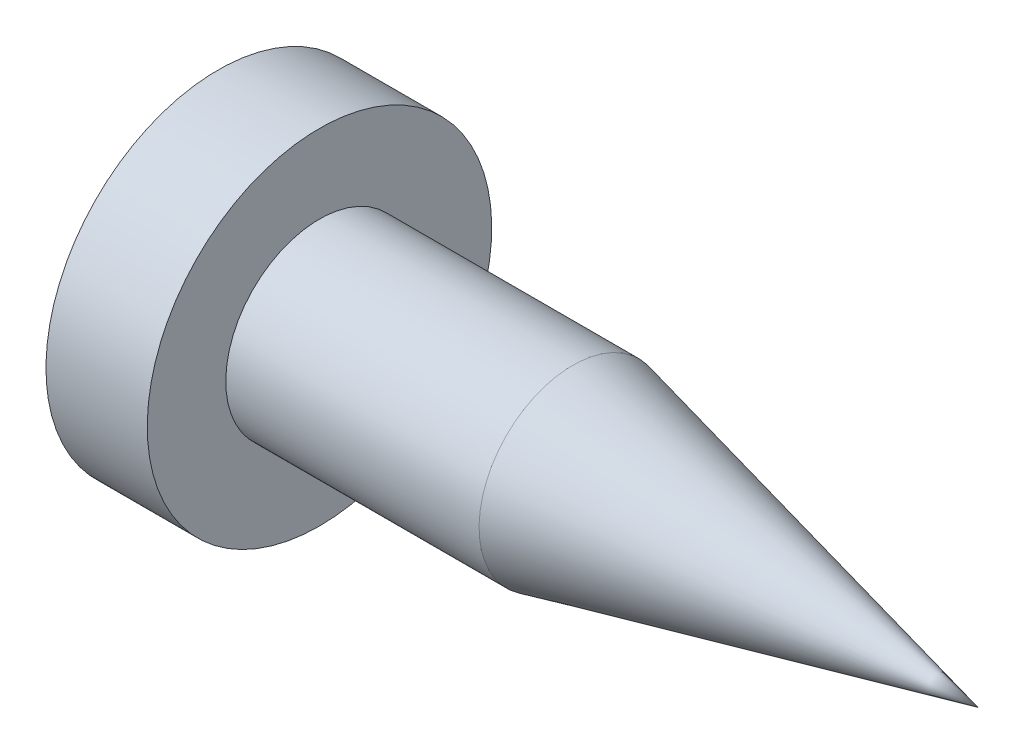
from build123d import *

# Parameters (mm, degrees)
ENL_V_MAT_EXTRU_1_DEPTH = 10


with BuildPart() as part:
    # Esquisse1 → Base-R_volution (revolve)
    with BuildSketch(Plane.XY, mode=Mode.PRIVATE) as base_r_volution_sk:
        with BuildLine():
            Line((0, 1.85), (5, 1.85))
            Line((5, 1.85), (13, 0))
            Line((13, 0), (-3, 0))
            ThreePointArc((-3, 0), (-2.74481535, 1.772004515), (-2, 3.4))
            Line((-2, 3.4), (0, 3.4))
            Line((0, 3.4), (0, 1.85))
        make_face()
    revolve(base_r_volution_sk.sketch.rotate(Axis((-2, 0, 0), (1, 0, 0)), 180), axis=Axis((-2, 0, 0), (1, 0, 0)))

    # Esquisse2 → Enl_v. mat.-Extru.1 (cut)
    with BuildSketch(Plane(origin=(-1, 0, 0), x_dir=(0, 0, -1), z_dir=(1, 0, 0))):
        with BuildLine():
            Line((0.7, -0.5), (2, -0.5))
            Line((2, -0.5), (2, 0.5))
            Line((2, 0.5), (0.7, 0.5))
            ThreePointArc((0.7, 0.5), (0.558578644, 0.558578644), (0.5, 0.7))
            Line((0.5, 0.7), (0.5, 2))
            Line((0.5, 2), (-0.5, 2))
            Line((-0.5, 2), (-0.5, 0.7))
            ThreePointArc((-0.5, 0.7), (-0.558578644, 0.558578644), (-0.7, 0.5))
            Line((-0.7, 0.5), (-2, 0.5))
            Line((-2, 0.5), (-2, -0.5))
            Line((-2, -0.5), (-0.7, -0.5))
            ThreePointArc((-0.7, -0.5), (-0.558578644, -0.558578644), (-0.5, -0.7))
            Line((-0.5, -0.7), (-0.5, -2))
            Line((-0.5, -2), (0.5, -2))
            Line((0.5, -2), (0.5, -0.7))
            ThreePointArc((0.5, -0.7), (0.558578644, -0.558578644), (0.7, -0.5))
        make_face()
    extrude(amount=-ENL_V_MAT_EXTRU_1_DEPTH, mode=Mode.SUBTRACT)


solid = part.part
